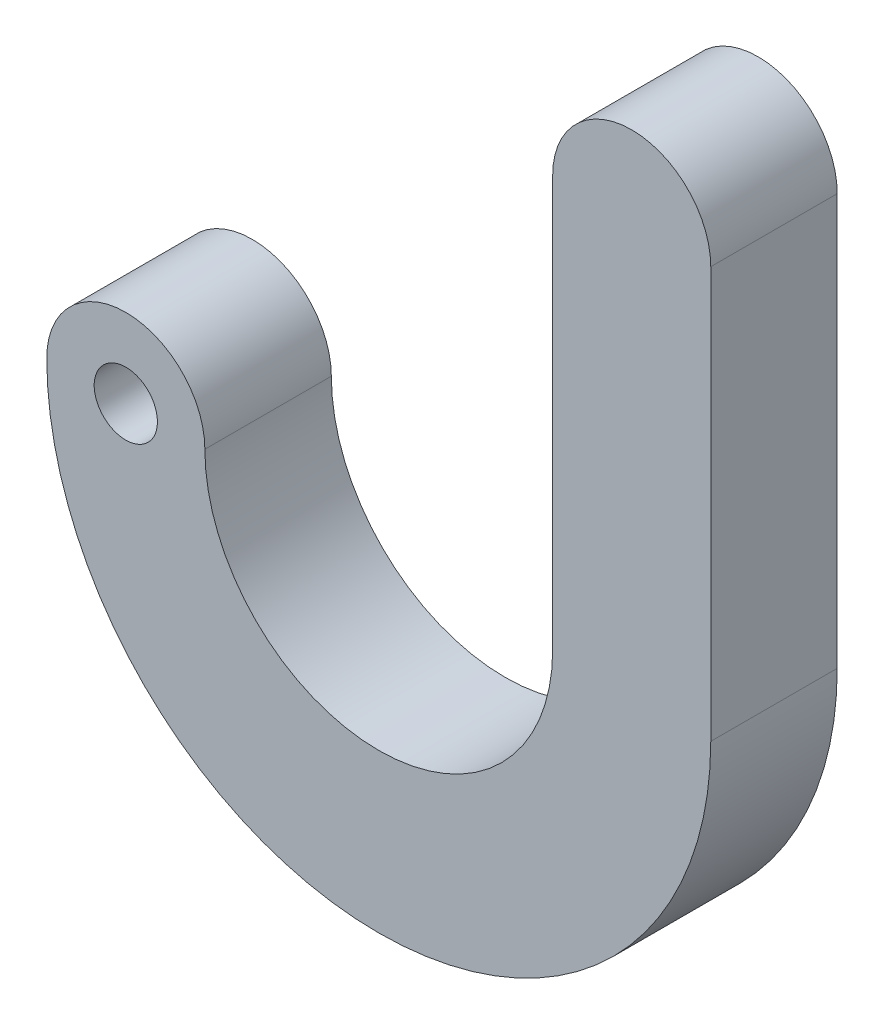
ISO-10303-21;
HEADER;
FILE_DESCRIPTION(('STEP AP214'),'2;1');
FILE_NAME('part.step','',(''),(''),'','','');
FILE_SCHEMA(('AUTOMOTIVE_DESIGN { 1 0 10303 214 1 1 1 1 }'));
ENDSEC;
DATA;
#1=APPLICATION_CONTEXT('core data for automotive mechanical design processes');
#2=APPLICATION_PROTOCOL_DEFINITION('international standard','automotive_design',2000,#1);
#3=PRODUCT_CONTEXT('',#1,'mechanical');
#4=PRODUCT('Part','Part','',(#3));
#5=PRODUCT_RELATED_PRODUCT_CATEGORY('part','',(#4));
#6=PRODUCT_DEFINITION_FORMATION('','',#4);
#7=PRODUCT_DEFINITION_CONTEXT('part definition',#1,'design');
#8=PRODUCT_DEFINITION('design','',#6,#7);
#9=PRODUCT_DEFINITION_SHAPE('','',#8);
#10=(LENGTH_UNIT() NAMED_UNIT(*) SI_UNIT(.MILLI.,.METRE.));
#11=(NAMED_UNIT(*) PLANE_ANGLE_UNIT() SI_UNIT($,.RADIAN.));
#12=(NAMED_UNIT(*) SI_UNIT($,.STERADIAN.) SOLID_ANGLE_UNIT());
#13=UNCERTAINTY_MEASURE_WITH_UNIT(LENGTH_MEASURE(1.E-05),#10,'distance_accuracy_value','');
#14=(GEOMETRIC_REPRESENTATION_CONTEXT(3) GLOBAL_UNCERTAINTY_ASSIGNED_CONTEXT((#13)) GLOBAL_UNIT_ASSIGNED_CONTEXT((#10,
#11,#12)) REPRESENTATION_CONTEXT('',''));
#15=CARTESIAN_POINT('',(0.,0.,0.));
#16=DIRECTION('',(0.,0.,1.));
#17=DIRECTION('',(1.,0.,0.));
#18=AXIS2_PLACEMENT_3D('',#15,#16,#17);
#19=CARTESIAN_POINT('',(8.,0.,4.));
#20=DIRECTION('',(0.,0.,1.));
#21=DIRECTION('',(1.,0.,0.));
#22=AXIS2_PLACEMENT_3D('',#19,#20,#21);
#23=PLANE('',#22);
#24=CARTESIAN_POINT('',(8.,0.,4.));
#25=DIRECTION('',(0.,0.,-1.));
#26=DIRECTION('',(1.,0.,0.));
#27=AXIS2_PLACEMENT_3D('',#24,#25,#26);
#28=CIRCLE('',#27,5.5);
#29=CARTESIAN_POINT('',(13.5,0.,4.));
#30=VERTEX_POINT('',#29);
#31=CARTESIAN_POINT('',(2.5,0.,4.));
#32=VERTEX_POINT('',#31);
#33=EDGE_CURVE('E130',#30,#32,#28,.T.);
#34=ORIENTED_EDGE('',*,*,#33,.T.);
#35=CARTESIAN_POINT('',(0.,0.,4.));
#36=DIRECTION('',(0.,0.,1.));
#37=DIRECTION('',(1.,0.,0.));
#38=AXIS2_PLACEMENT_3D('',#35,#36,#37);
#39=CIRCLE('',#38,2.5);
#40=CARTESIAN_POINT('',(-2.5,0.,4.));
#41=VERTEX_POINT('',#40);
#42=EDGE_CURVE('E88',#32,#41,#39,.T.);
#43=ORIENTED_EDGE('',*,*,#42,.T.);
#44=CARTESIAN_POINT('',(8.,0.,4.));
#45=DIRECTION('',(0.,0.,1.));
#46=DIRECTION('',(1.,0.,0.));
#47=AXIS2_PLACEMENT_3D('',#44,#45,#46);
#48=CIRCLE('',#47,10.5);
#49=CARTESIAN_POINT('',(18.5,0.,4.));
#50=VERTEX_POINT('',#49);
#51=EDGE_CURVE('E101',#41,#50,#48,.T.);
#52=ORIENTED_EDGE('',*,*,#51,.T.);
#53=DIRECTION('',(0.,1.,0.));
#54=VECTOR('',#53,1.);
#55=CARTESIAN_POINT('',(18.5,0.,4.));
#56=LINE('',#55,#54);
#57=CARTESIAN_POINT('',(18.5,13.,4.));
#58=VERTEX_POINT('',#57);
#59=EDGE_CURVE('E95',#50,#58,#56,.T.);
#60=ORIENTED_EDGE('',*,*,#59,.T.);
#61=CARTESIAN_POINT('',(16.,13.,4.));
#62=DIRECTION('',(0.,0.,1.));
#63=DIRECTION('',(1.,0.,0.));
#64=AXIS2_PLACEMENT_3D('',#61,#62,#63);
#65=CIRCLE('',#64,2.5);
#66=CARTESIAN_POINT('',(13.5,13.,4.));
#67=VERTEX_POINT('',#66);
#68=EDGE_CURVE('E99',#58,#67,#65,.T.);
#69=ORIENTED_EDGE('',*,*,#68,.T.);
#70=DIRECTION('',(0.,-1.,0.));
#71=VECTOR('',#70,1.);
#72=CARTESIAN_POINT('',(13.5,0.,4.));
#73=LINE('',#72,#71);
#74=EDGE_CURVE('E51',#67,#30,#73,.T.);
#75=ORIENTED_EDGE('',*,*,#74,.T.);
#76=EDGE_LOOP('',(#34,#43,#52,#60,#69,#75));
#77=FACE_BOUND('',#76,.T.);
#78=CARTESIAN_POINT('',(0.,0.,4.));
#79=DIRECTION('',(0.,0.,1.));
#80=DIRECTION('',(1.,0.,0.));
#81=AXIS2_PLACEMENT_3D('',#78,#79,#80);
#82=CIRCLE('',#81,1.);
#83=CARTESIAN_POINT('',(1.,0.,4.));
#84=VERTEX_POINT('',#83);
#85=EDGE_CURVE('E123',#84,#84,#82,.T.);
#86=ORIENTED_EDGE('',*,*,#85,.F.);
#87=EDGE_LOOP('',(#86));
#88=FACE_BOUND('',#87,.T.);
#89=ADVANCED_FACE('F34',(#77,#88),#23,.T.);
#90=CARTESIAN_POINT('',(8.,0.,0.));
#91=DIRECTION('',(0.,0.,1.));
#92=DIRECTION('',(1.,0.,0.));
#93=AXIS2_PLACEMENT_3D('',#90,#91,#92);
#94=PLANE('',#93);
#95=CARTESIAN_POINT('',(8.,0.,0.));
#96=DIRECTION('',(0.,0.,-1.));
#97=DIRECTION('',(1.,0.,0.));
#98=AXIS2_PLACEMENT_3D('',#95,#96,#97);
#99=CIRCLE('',#98,5.5);
#100=CARTESIAN_POINT('',(13.5,0.,0.));
#101=VERTEX_POINT('',#100);
#102=CARTESIAN_POINT('',(2.5,0.,0.));
#103=VERTEX_POINT('',#102);
#104=EDGE_CURVE('E119',#101,#103,#99,.T.);
#105=ORIENTED_EDGE('',*,*,#104,.F.);
#106=DIRECTION('',(0.,-1.,0.));
#107=VECTOR('',#106,1.);
#108=CARTESIAN_POINT('',(13.5,0.,0.));
#109=LINE('',#108,#107);
#110=CARTESIAN_POINT('',(13.5,13.,0.));
#111=VERTEX_POINT('',#110);
#112=EDGE_CURVE('E80',#111,#101,#109,.T.);
#113=ORIENTED_EDGE('',*,*,#112,.F.);
#114=CARTESIAN_POINT('',(16.,13.,0.));
#115=DIRECTION('',(0.,0.,1.));
#116=DIRECTION('',(1.,0.,0.));
#117=AXIS2_PLACEMENT_3D('',#114,#115,#116);
#118=CIRCLE('',#117,2.5);
#119=CARTESIAN_POINT('',(18.5,13.,0.));
#120=VERTEX_POINT('',#119);
#121=EDGE_CURVE('E74',#120,#111,#118,.T.);
#122=ORIENTED_EDGE('',*,*,#121,.F.);
#123=DIRECTION('',(0.,1.,0.));
#124=VECTOR('',#123,1.);
#125=CARTESIAN_POINT('',(18.5,0.,0.));
#126=LINE('',#125,#124);
#127=CARTESIAN_POINT('',(18.5,0.,0.));
#128=VERTEX_POINT('',#127);
#129=EDGE_CURVE('E109',#128,#120,#126,.T.);
#130=ORIENTED_EDGE('',*,*,#129,.F.);
#131=CARTESIAN_POINT('',(8.,0.,0.));
#132=DIRECTION('',(0.,0.,1.));
#133=DIRECTION('',(1.,0.,0.));
#134=AXIS2_PLACEMENT_3D('',#131,#132,#133);
#135=CIRCLE('',#134,10.5);
#136=CARTESIAN_POINT('',(-2.5,0.,0.));
#137=VERTEX_POINT('',#136);
#138=EDGE_CURVE('E125',#137,#128,#135,.T.);
#139=ORIENTED_EDGE('',*,*,#138,.F.);
#140=CARTESIAN_POINT('',(0.,0.,0.));
#141=DIRECTION('',(0.,0.,1.));
#142=DIRECTION('',(1.,0.,0.));
#143=AXIS2_PLACEMENT_3D('',#140,#141,#142);
#144=CIRCLE('',#143,2.5);
#145=EDGE_CURVE('E122',#103,#137,#144,.T.);
#146=ORIENTED_EDGE('',*,*,#145,.F.);
#147=EDGE_LOOP('',(#105,#113,#122,#130,#139,#146));
#148=FACE_BOUND('',#147,.T.);
#149=CARTESIAN_POINT('',(0.,0.,0.));
#150=DIRECTION('',(0.,0.,1.));
#151=DIRECTION('',(1.,0.,0.));
#152=AXIS2_PLACEMENT_3D('',#149,#150,#151);
#153=CIRCLE('',#152,1.);
#154=CARTESIAN_POINT('',(1.,0.,0.));
#155=VERTEX_POINT('',#154);
#156=EDGE_CURVE('E223',#155,#155,#153,.T.);
#157=ORIENTED_EDGE('',*,*,#156,.T.);
#158=EDGE_LOOP('',(#157));
#159=FACE_BOUND('',#158,.T.);
#160=ADVANCED_FACE('F139',(#148,#159),#94,.F.);
#161=CARTESIAN_POINT('',(8.,0.,4.));
#162=DIRECTION('',(0.,0.,-1.));
#163=DIRECTION('',(-1.,0.,0.));
#164=AXIS2_PLACEMENT_3D('',#161,#162,#163);
#165=CYLINDRICAL_SURFACE('',#164,5.5);
#166=ORIENTED_EDGE('',*,*,#104,.T.);
#167=DIRECTION('',(0.,0.,-1.));
#168=VECTOR('',#167,1.);
#169=CARTESIAN_POINT('',(2.5,0.,4.));
#170=LINE('',#169,#168);
#171=EDGE_CURVE('E11',#32,#103,#170,.T.);
#172=ORIENTED_EDGE('',*,*,#171,.F.);
#173=ORIENTED_EDGE('',*,*,#33,.F.);
#174=DIRECTION('',(0.,0.,-1.));
#175=VECTOR('',#174,1.);
#176=CARTESIAN_POINT('',(13.5,0.,4.));
#177=LINE('',#176,#175);
#178=EDGE_CURVE('E115',#30,#101,#177,.T.);
#179=ORIENTED_EDGE('',*,*,#178,.T.);
#180=EDGE_LOOP('',(#166,#172,#173,#179));
#181=FACE_BOUND('',#180,.T.);
#182=ADVANCED_FACE('F36',(#181),#165,.F.);
#183=CARTESIAN_POINT('',(0.,0.,4.));
#184=DIRECTION('',(0.,0.,-1.));
#185=DIRECTION('',(-1.,0.,0.));
#186=AXIS2_PLACEMENT_3D('',#183,#184,#185);
#187=CYLINDRICAL_SURFACE('',#186,2.5);
#188=ORIENTED_EDGE('',*,*,#145,.T.);
#189=DIRECTION('',(0.,0.,-1.));
#190=VECTOR('',#189,1.);
#191=CARTESIAN_POINT('',(-2.5,0.,4.));
#192=LINE('',#191,#190);
#193=EDGE_CURVE('E43',#41,#137,#192,.T.);
#194=ORIENTED_EDGE('',*,*,#193,.F.);
#195=ORIENTED_EDGE('',*,*,#42,.F.);
#196=ORIENTED_EDGE('',*,*,#171,.T.);
#197=EDGE_LOOP('',(#188,#194,#195,#196));
#198=FACE_BOUND('',#197,.T.);
#199=ADVANCED_FACE('F164',(#198),#187,.T.);
#200=CARTESIAN_POINT('',(8.,0.,4.));
#201=DIRECTION('',(0.,0.,-1.));
#202=DIRECTION('',(-1.,0.,0.));
#203=AXIS2_PLACEMENT_3D('',#200,#201,#202);
#204=CYLINDRICAL_SURFACE('',#203,10.5);
#205=ORIENTED_EDGE('',*,*,#138,.T.);
#206=DIRECTION('',(0.,0.,-1.));
#207=VECTOR('',#206,1.);
#208=CARTESIAN_POINT('',(18.5,0.,4.));
#209=LINE('',#208,#207);
#210=EDGE_CURVE('E110',#50,#128,#209,.T.);
#211=ORIENTED_EDGE('',*,*,#210,.F.);
#212=ORIENTED_EDGE('',*,*,#51,.F.);
#213=ORIENTED_EDGE('',*,*,#193,.T.);
#214=EDGE_LOOP('',(#205,#211,#212,#213));
#215=FACE_BOUND('',#214,.T.);
#216=ADVANCED_FACE('F136',(#215),#204,.T.);
#217=CARTESIAN_POINT('',(18.5,0.,4.));
#218=DIRECTION('',(-1.,0.,0.));
#219=DIRECTION('',(0.,-1.,0.));
#220=AXIS2_PLACEMENT_3D('',#217,#218,#219);
#221=PLANE('',#220);
#222=ORIENTED_EDGE('',*,*,#129,.T.);
#223=DIRECTION('',(0.,0.,-1.));
#224=VECTOR('',#223,1.);
#225=CARTESIAN_POINT('',(18.5,13.,4.));
#226=LINE('',#225,#224);
#227=EDGE_CURVE('E106',#58,#120,#226,.T.);
#228=ORIENTED_EDGE('',*,*,#227,.F.);
#229=ORIENTED_EDGE('',*,*,#59,.F.);
#230=ORIENTED_EDGE('',*,*,#210,.T.);
#231=EDGE_LOOP('',(#222,#228,#229,#230));
#232=FACE_BOUND('',#231,.T.);
#233=ADVANCED_FACE('F107',(#232),#221,.F.);
#234=CARTESIAN_POINT('',(16.,13.,4.));
#235=DIRECTION('',(0.,0.,-1.));
#236=DIRECTION('',(-1.,0.,0.));
#237=AXIS2_PLACEMENT_3D('',#234,#235,#236);
#238=CYLINDRICAL_SURFACE('',#237,2.5);
#239=ORIENTED_EDGE('',*,*,#121,.T.);
#240=DIRECTION('',(0.,0.,-1.));
#241=VECTOR('',#240,1.);
#242=CARTESIAN_POINT('',(13.5,13.,4.));
#243=LINE('',#242,#241);
#244=EDGE_CURVE('E111',#67,#111,#243,.T.);
#245=ORIENTED_EDGE('',*,*,#244,.F.);
#246=ORIENTED_EDGE('',*,*,#68,.F.);
#247=ORIENTED_EDGE('',*,*,#227,.T.);
#248=EDGE_LOOP('',(#239,#245,#246,#247));
#249=FACE_BOUND('',#248,.T.);
#250=ADVANCED_FACE('F113',(#249),#238,.T.);
#251=CARTESIAN_POINT('',(13.5,0.,4.));
#252=DIRECTION('',(1.,0.,0.));
#253=DIRECTION('',(0.,0.,-1.));
#254=AXIS2_PLACEMENT_3D('',#251,#252,#253);
#255=PLANE('',#254);
#256=ORIENTED_EDGE('',*,*,#112,.T.);
#257=ORIENTED_EDGE('',*,*,#178,.F.);
#258=ORIENTED_EDGE('',*,*,#74,.F.);
#259=ORIENTED_EDGE('',*,*,#244,.T.);
#260=EDGE_LOOP('',(#256,#257,#258,#259));
#261=FACE_BOUND('',#260,.T.);
#262=ADVANCED_FACE('F144',(#261),#255,.F.);
#263=CARTESIAN_POINT('',(0.,0.,4.));
#264=DIRECTION('',(0.,0.,-1.));
#265=DIRECTION('',(-1.,0.,0.));
#266=AXIS2_PLACEMENT_3D('',#263,#264,#265);
#267=CYLINDRICAL_SURFACE('',#266,1.);
#268=ORIENTED_EDGE('',*,*,#85,.T.);
#269=EDGE_LOOP('',(#268));
#270=FACE_BOUND('',#269,.T.);
#271=ORIENTED_EDGE('',*,*,#156,.F.);
#272=EDGE_LOOP('',(#271));
#273=FACE_BOUND('',#272,.T.);
#274=ADVANCED_FACE('F146',(#270,#273),#267,.F.);
#275=CLOSED_SHELL('',(#89,#160,#182,#199,#216,#233,#250,#262,#274));
#276=MANIFOLD_SOLID_BREP('B2',#275);
#277=ADVANCED_BREP_SHAPE_REPRESENTATION('',(#18,#276),#14);
#278=SHAPE_DEFINITION_REPRESENTATION(#9,#277);
ENDSEC;
END-ISO-10303-21;
